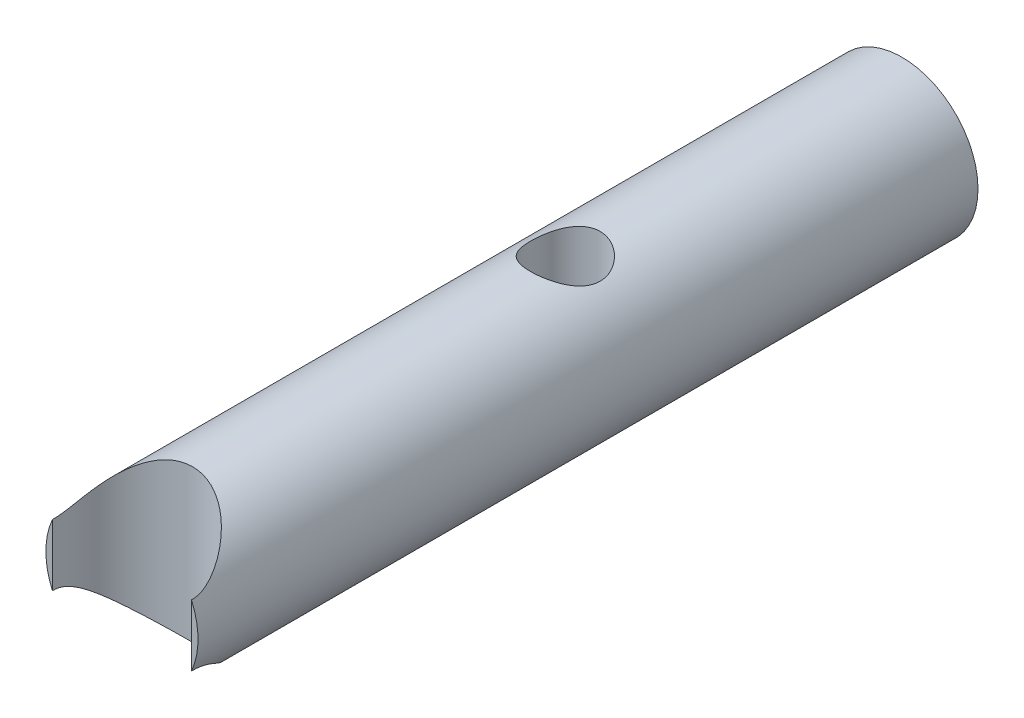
ISO-10303-21;
HEADER;
FILE_DESCRIPTION(('STEP AP214'),'2;1');
FILE_NAME('part.step','',(''),(''),'','','');
FILE_SCHEMA(('AUTOMOTIVE_DESIGN { 1 0 10303 214 1 1 1 1 }'));
ENDSEC;
DATA;
#1=APPLICATION_CONTEXT('core data for automotive mechanical design processes');
#2=APPLICATION_PROTOCOL_DEFINITION('international standard','automotive_design',2000,#1);
#3=PRODUCT_CONTEXT('',#1,'mechanical');
#4=PRODUCT('Part','Part','',(#3));
#5=PRODUCT_RELATED_PRODUCT_CATEGORY('part','',(#4));
#6=PRODUCT_DEFINITION_FORMATION('','',#4);
#7=PRODUCT_DEFINITION_CONTEXT('part definition',#1,'design');
#8=PRODUCT_DEFINITION('design','',#6,#7);
#9=PRODUCT_DEFINITION_SHAPE('','',#8);
#10=(LENGTH_UNIT() NAMED_UNIT(*) SI_UNIT(.MILLI.,.METRE.));
#11=(NAMED_UNIT(*) PLANE_ANGLE_UNIT() SI_UNIT($,.RADIAN.));
#12=(NAMED_UNIT(*) SI_UNIT($,.STERADIAN.) SOLID_ANGLE_UNIT());
#13=UNCERTAINTY_MEASURE_WITH_UNIT(LENGTH_MEASURE(1.E-05),#10,'distance_accuracy_value','');
#14=(GEOMETRIC_REPRESENTATION_CONTEXT(3) GLOBAL_UNCERTAINTY_ASSIGNED_CONTEXT((#13)) GLOBAL_UNIT_ASSIGNED_CONTEXT((#10,
#11,#12)) REPRESENTATION_CONTEXT('',''));
#15=CARTESIAN_POINT('',(0.,0.,0.));
#16=DIRECTION('',(0.,0.,1.));
#17=DIRECTION('',(1.,0.,0.));
#18=AXIS2_PLACEMENT_3D('',#15,#16,#17);
#19=CARTESIAN_POINT('',(0.,0.,28.04));
#20=DIRECTION('',(0.,0.,1.));
#21=DIRECTION('',(1.,0.,0.));
#22=AXIS2_PLACEMENT_3D('',#19,#20,#21);
#23=PLANE('',#22);
#24=DIRECTION('',(0.,1.,0.));
#25=VECTOR('',#24,1.);
#26=CARTESIAN_POINT('',(2.49967997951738,-2.735,28.04));
#27=LINE('',#26,#25);
#28=CARTESIAN_POINT('',(2.49967997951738,-1.10987611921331,28.04));
#29=VERTEX_POINT('',#28);
#30=CARTESIAN_POINT('',(2.49967997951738,1.10987611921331,28.04));
#31=VERTEX_POINT('',#30);
#32=EDGE_CURVE('E389',#29,#31,#27,.T.);
#33=ORIENTED_EDGE('',*,*,#32,.F.);
#34=CARTESIAN_POINT('',(0.,0.,28.04));
#35=DIRECTION('',(0.,0.,1.));
#36=DIRECTION('',(1.,0.,0.));
#37=AXIS2_PLACEMENT_3D('',#34,#35,#36);
#38=CIRCLE('',#37,2.735);
#39=EDGE_CURVE('E383',#29,#31,#38,.T.);
#40=ORIENTED_EDGE('',*,*,#39,.T.);
#41=EDGE_LOOP('',(#33,#40));
#42=FACE_BOUND('',#41,.T.);
#43=ADVANCED_FACE('F348',(#42),#23,.T.);
#44=CARTESIAN_POINT('',(0.,0.,28.04));
#45=DIRECTION('',(0.,0.,-1.));
#46=DIRECTION('',(-1.,0.,0.));
#47=AXIS2_PLACEMENT_3D('',#44,#45,#46);
#48=CYLINDRICAL_SURFACE('',#47,2.735);
#49=CARTESIAN_POINT('',(0.,-2.735,13.35));
#50=CARTESIAN_POINT('',(0.0663724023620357,-2.73499716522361,13.3499965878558));
#51=CARTESIAN_POINT('',(0.132843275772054,-2.73255715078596,13.3446825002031));
#52=CARTESIAN_POINT('',(0.263861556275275,-2.72303863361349,13.3236419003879));
#53=CARTESIAN_POINT('',(0.328404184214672,-2.71594946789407,13.3078914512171));
#54=CARTESIAN_POINT('',(0.453464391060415,-2.69788296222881,13.2666993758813));
#55=CARTESIAN_POINT('',(0.513995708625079,-2.68691980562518,13.2412930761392));
#56=CARTESIAN_POINT('',(0.629865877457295,-2.66214372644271,13.1816735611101));
#57=CARTESIAN_POINT('',(0.685205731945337,-2.64833135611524,13.1474620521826));
#58=CARTESIAN_POINT('',(0.792427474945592,-2.61830973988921,13.0691221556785));
#59=CARTESIAN_POINT('',(0.84397047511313,-2.60201224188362,13.0245641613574));
#60=CARTESIAN_POINT('',(0.93915409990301,-2.56919329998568,12.9277105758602));
#61=CARTESIAN_POINT('',(0.982789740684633,-2.55267172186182,12.8754101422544));
#62=CARTESIAN_POINT('',(1.06360908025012,-2.52011439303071,12.7606502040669));
#63=CARTESIAN_POINT('',(1.10022614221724,-2.50417203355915,12.6977622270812));
#64=CARTESIAN_POINT('',(1.16221291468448,-2.47601566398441,12.5658963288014));
#65=CARTESIAN_POINT('',(1.18758954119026,-2.46379936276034,12.4969221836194));
#66=CARTESIAN_POINT('',(1.22490745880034,-2.44545302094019,12.358726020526));
#67=CARTESIAN_POINT('',(1.23750543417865,-2.43902763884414,12.2897222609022));
#68=CARTESIAN_POINT('',(1.25094529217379,-2.4321645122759,12.1503048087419));
#69=CARTESIAN_POINT('',(1.25179574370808,-2.4317224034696,12.0798921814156));
#70=CARTESIAN_POINT('',(1.24220413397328,-2.43663118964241,11.9468792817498));
#71=CARTESIAN_POINT('',(1.23283602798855,-2.44143120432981,11.8841767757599));
#72=CARTESIAN_POINT('',(1.2049022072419,-2.45533633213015,11.761357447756));
#73=CARTESIAN_POINT('',(1.18633426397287,-2.46444248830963,11.7012412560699));
#74=CARTESIAN_POINT('',(1.14016129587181,-2.48614520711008,11.5836518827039));
#75=CARTESIAN_POINT('',(1.11235959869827,-2.49881672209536,11.5262703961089));
#76=CARTESIAN_POINT('',(1.04865127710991,-2.52621382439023,11.4167363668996));
#77=CARTESIAN_POINT('',(1.01274116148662,-2.54094029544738,11.3645860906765));
#78=CARTESIAN_POINT('',(0.929479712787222,-2.57263933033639,11.2613044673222));
#79=CARTESIAN_POINT('',(0.881328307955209,-2.58968649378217,11.210838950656));
#80=CARTESIAN_POINT('',(0.777116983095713,-2.62284256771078,11.1184501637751));
#81=CARTESIAN_POINT('',(0.721054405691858,-2.63895116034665,11.0765297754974));
#82=CARTESIAN_POINT('',(0.600235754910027,-2.66907069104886,11.0011607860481));
#83=CARTESIAN_POINT('',(0.535254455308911,-2.68299524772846,10.9680360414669));
#84=CARTESIAN_POINT('',(0.399841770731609,-2.70648478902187,10.9134310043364));
#85=CARTESIAN_POINT('',(0.329414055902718,-2.71605268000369,10.8919429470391));
#86=CARTESIAN_POINT('',(0.1906235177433,-2.72917351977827,10.8627371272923));
#87=CARTESIAN_POINT('',(0.122484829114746,-2.73311432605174,10.8541292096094));
#88=CARTESIAN_POINT('',(-0.0143738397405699,-2.73581719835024,10.8482094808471));
#89=CARTESIAN_POINT('',(-0.0830935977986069,-2.73458116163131,10.8508935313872));
#90=CARTESIAN_POINT('',(-0.214640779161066,-2.72731146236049,10.8668954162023));
#91=CARTESIAN_POINT('',(-0.277568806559,-2.72158105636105,10.8795413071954));
#92=CARTESIAN_POINT('',(-0.400314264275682,-2.70625226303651,10.9141182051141));
#93=CARTESIAN_POINT('',(-0.460131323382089,-2.69665341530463,10.9360503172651));
#94=CARTESIAN_POINT('',(-0.577067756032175,-2.67411203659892,10.9892580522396));
#95=CARTESIAN_POINT('',(-0.634046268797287,-2.66107518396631,11.0208019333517));
#96=CARTESIAN_POINT('',(-0.742105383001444,-2.63298815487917,11.0920453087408));
#97=CARTESIAN_POINT('',(-0.793183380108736,-2.61793709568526,11.131748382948));
#98=CARTESIAN_POINT('',(-0.892559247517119,-2.58582979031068,11.2220930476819));
#99=CARTESIAN_POINT('',(-0.940255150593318,-2.56871168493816,11.2733763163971));
#100=CARTESIAN_POINT('',(-1.02658207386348,-2.53544851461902,11.3833961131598));
#101=CARTESIAN_POINT('',(-1.06520926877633,-2.51930386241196,11.4421357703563));
#102=CARTESIAN_POINT('',(-1.13326671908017,-2.48944894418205,11.5676091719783));
#103=CARTESIAN_POINT('',(-1.16240482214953,-2.47582077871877,11.6345224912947));
#104=CARTESIAN_POINT('',(-1.20871129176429,-2.45355122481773,11.773133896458));
#105=CARTESIAN_POINT('',(-1.22589223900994,-2.44490459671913,11.8448268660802));
#106=CARTESIAN_POINT('',(-1.24643587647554,-2.43449032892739,11.9841808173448));
#107=CARTESIAN_POINT('',(-1.25088072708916,-2.43218469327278,12.0516420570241));
#108=CARTESIAN_POINT('',(-1.24883066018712,-2.43323851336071,12.1863445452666));
#109=CARTESIAN_POINT('',(-1.24233846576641,-2.43659655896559,12.2535858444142));
#110=CARTESIAN_POINT('',(-1.21956205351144,-2.44806799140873,12.3812304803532));
#111=CARTESIAN_POINT('',(-1.20396488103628,-2.45584679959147,12.4417897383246));
#112=CARTESIAN_POINT('',(-1.16417245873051,-2.47495694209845,12.5594128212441));
#113=CARTESIAN_POINT('',(-1.13997468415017,-2.48628931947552,12.6164756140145));
#114=CARTESIAN_POINT('',(-1.08186347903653,-2.5121443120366,12.7295835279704));
#115=CARTESIAN_POINT('',(-1.04741793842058,-2.52682715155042,12.785317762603));
#116=CARTESIAN_POINT('',(-0.970456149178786,-2.55737231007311,12.8905494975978));
#117=CARTESIAN_POINT('',(-0.92793629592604,-2.57323515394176,12.9400441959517));
#118=CARTESIAN_POINT('',(-0.8312839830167,-2.60615328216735,13.0362388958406));
#119=CARTESIAN_POINT('',(-0.776433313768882,-2.62317932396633,13.0822309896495));
#120=CARTESIAN_POINT('',(-0.659217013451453,-2.65505978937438,13.1644512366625));
#121=CARTESIAN_POINT('',(-0.596847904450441,-2.66991320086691,13.2006748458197));
#122=CARTESIAN_POINT('',(-0.466673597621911,-2.69570161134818,13.261828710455));
#123=CARTESIAN_POINT('',(-0.398916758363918,-2.70666750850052,13.2868484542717));
#124=CARTESIAN_POINT('',(-0.259627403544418,-2.7235460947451,13.3248562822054));
#125=CARTESIAN_POINT('',(-0.188106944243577,-2.72947398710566,13.3378805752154));
#126=CARTESIAN_POINT('',(-0.0967321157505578,-2.73335792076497,13.3464030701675));
#127=CARTESIAN_POINT('',(-0.0774179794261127,-2.73397254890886,13.3477505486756));
#128=CARTESIAN_POINT('',(-0.0387386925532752,-2.73479400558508,13.3495495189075));
#129=CARTESIAN_POINT('',(-0.0193735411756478,-2.73500082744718,13.350000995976));
#130=CARTESIAN_POINT('',(0.,-2.735,13.35));
#131=B_SPLINE_CURVE_WITH_KNOTS('',3,(#49,#50,#51,#52,#53,#54,#55,#56,#57,#58,#59,#60,#61,#62,
#63,#64,#65,#66,#67,#68,#69,#70,#71,#72,#73,#74,#75,#76,#77,#78,#79,#80,#81,#82,#83,#84,#85,#86,
#87,#88,#89,#90,#91,#92,#93,#94,#95,#96,#97,#98,#99,#100,#101,#102,#103,#104,#105,#106,#107,
#108,#109,#110,#111,#112,#113,#114,#115,#116,#117,#118,#119,#120,#121,#122,#123,#124,#125,#126,
#127,#128,#129,#130),.UNSPECIFIED.,.T.,.F.,(4,2,2,2,2,2,2,2,2,2,2,2,2,2,2,2,2,2,2,2,2,2,2,2,2,2,
2,2,2,2,2,2,2,2,2,2,2,2,2,2,4),(0.,0.199037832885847,0.398533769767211,0.597306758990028,
0.79604125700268,1.00531223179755,1.21471465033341,1.43708025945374,1.65930886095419,
1.86942947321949,2.07939681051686,2.26925045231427,2.45915010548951,2.65338594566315,
2.84770557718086,3.06216563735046,3.27669790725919,3.49828369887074,3.7197214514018,
3.92500604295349,4.13021540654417,4.32265816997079,4.51512384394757,4.71354839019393,
4.91206018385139,5.12738683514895,5.34280415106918,5.56433561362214,5.78563363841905,
5.98747377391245,6.18926366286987,6.37749887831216,6.56578939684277,6.76639997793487,
6.96710032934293,7.18679672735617,7.40659514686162,7.62460521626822,7.84195503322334,
7.90005153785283,7.9581489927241),.UNSPECIFIED.);
#132=CARTESIAN_POINT('',(0.,-2.735,13.35));
#133=VERTEX_POINT('',#132);
#134=EDGE_CURVE('E11',#133,#133,#131,.T.);
#135=ORIENTED_EDGE('',*,*,#134,.T.);
#136=EDGE_LOOP('',(#135));
#137=FACE_BOUND('',#136,.T.);
#138=CARTESIAN_POINT('',(0.,2.735,13.35));
#139=CARTESIAN_POINT('',(-0.0663724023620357,2.73499716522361,13.3499965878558));
#140=CARTESIAN_POINT('',(-0.132843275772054,2.73255715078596,13.3446825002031));
#141=CARTESIAN_POINT('',(-0.263861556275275,2.72303863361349,13.3236419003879));
#142=CARTESIAN_POINT('',(-0.328404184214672,2.71594946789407,13.3078914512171));
#143=CARTESIAN_POINT('',(-0.453464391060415,2.69788296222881,13.2666993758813));
#144=CARTESIAN_POINT('',(-0.513995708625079,2.68691980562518,13.2412930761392));
#145=CARTESIAN_POINT('',(-0.629865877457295,2.66214372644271,13.1816735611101));
#146=CARTESIAN_POINT('',(-0.685205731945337,2.64833135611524,13.1474620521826));
#147=CARTESIAN_POINT('',(-0.792427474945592,2.61830973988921,13.0691221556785));
#148=CARTESIAN_POINT('',(-0.84397047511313,2.60201224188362,13.0245641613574));
#149=CARTESIAN_POINT('',(-0.93915409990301,2.56919329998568,12.9277105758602));
#150=CARTESIAN_POINT('',(-0.982789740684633,2.55267172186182,12.8754101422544));
#151=CARTESIAN_POINT('',(-1.06360908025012,2.52011439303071,12.7606502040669));
#152=CARTESIAN_POINT('',(-1.10022614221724,2.50417203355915,12.6977622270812));
#153=CARTESIAN_POINT('',(-1.16221291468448,2.47601566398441,12.5658963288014));
#154=CARTESIAN_POINT('',(-1.18758954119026,2.46379936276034,12.4969221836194));
#155=CARTESIAN_POINT('',(-1.22490745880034,2.44545302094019,12.358726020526));
#156=CARTESIAN_POINT('',(-1.23750543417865,2.43902763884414,12.2897222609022));
#157=CARTESIAN_POINT('',(-1.25094529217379,2.4321645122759,12.1503048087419));
#158=CARTESIAN_POINT('',(-1.25179574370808,2.4317224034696,12.0798921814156));
#159=CARTESIAN_POINT('',(-1.24220413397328,2.43663118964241,11.9468792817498));
#160=CARTESIAN_POINT('',(-1.23283602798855,2.44143120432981,11.8841767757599));
#161=CARTESIAN_POINT('',(-1.2049022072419,2.45533633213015,11.761357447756));
#162=CARTESIAN_POINT('',(-1.18633426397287,2.46444248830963,11.7012412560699));
#163=CARTESIAN_POINT('',(-1.14016129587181,2.48614520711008,11.5836518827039));
#164=CARTESIAN_POINT('',(-1.11235959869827,2.49881672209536,11.5262703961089));
#165=CARTESIAN_POINT('',(-1.04865127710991,2.52621382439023,11.4167363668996));
#166=CARTESIAN_POINT('',(-1.01274116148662,2.54094029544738,11.3645860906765));
#167=CARTESIAN_POINT('',(-0.929479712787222,2.57263933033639,11.2613044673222));
#168=CARTESIAN_POINT('',(-0.881328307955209,2.58968649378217,11.210838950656));
#169=CARTESIAN_POINT('',(-0.777116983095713,2.62284256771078,11.1184501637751));
#170=CARTESIAN_POINT('',(-0.721054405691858,2.63895116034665,11.0765297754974));
#171=CARTESIAN_POINT('',(-0.600235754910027,2.66907069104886,11.0011607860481));
#172=CARTESIAN_POINT('',(-0.535254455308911,2.68299524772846,10.9680360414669));
#173=CARTESIAN_POINT('',(-0.399841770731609,2.70648478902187,10.9134310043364));
#174=CARTESIAN_POINT('',(-0.329414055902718,2.71605268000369,10.8919429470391));
#175=CARTESIAN_POINT('',(-0.1906235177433,2.72917351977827,10.8627371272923));
#176=CARTESIAN_POINT('',(-0.122484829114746,2.73311432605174,10.8541292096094));
#177=CARTESIAN_POINT('',(0.0143738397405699,2.73581719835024,10.8482094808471));
#178=CARTESIAN_POINT('',(0.0830935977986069,2.73458116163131,10.8508935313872));
#179=CARTESIAN_POINT('',(0.214640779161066,2.72731146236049,10.8668954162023));
#180=CARTESIAN_POINT('',(0.277568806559,2.72158105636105,10.8795413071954));
#181=CARTESIAN_POINT('',(0.400314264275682,2.70625226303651,10.9141182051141));
#182=CARTESIAN_POINT('',(0.460131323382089,2.69665341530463,10.9360503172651));
#183=CARTESIAN_POINT('',(0.577067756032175,2.67411203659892,10.9892580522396));
#184=CARTESIAN_POINT('',(0.634046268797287,2.66107518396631,11.0208019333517));
#185=CARTESIAN_POINT('',(0.742105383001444,2.63298815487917,11.0920453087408));
#186=CARTESIAN_POINT('',(0.793183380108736,2.61793709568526,11.131748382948));
#187=CARTESIAN_POINT('',(0.892559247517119,2.58582979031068,11.2220930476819));
#188=CARTESIAN_POINT('',(0.940255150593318,2.56871168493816,11.2733763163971));
#189=CARTESIAN_POINT('',(1.02658207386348,2.53544851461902,11.3833961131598));
#190=CARTESIAN_POINT('',(1.06520926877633,2.51930386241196,11.4421357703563));
#191=CARTESIAN_POINT('',(1.13326671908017,2.48944894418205,11.5676091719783));
#192=CARTESIAN_POINT('',(1.16240482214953,2.47582077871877,11.6345224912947));
#193=CARTESIAN_POINT('',(1.20871129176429,2.45355122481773,11.773133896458));
#194=CARTESIAN_POINT('',(1.22589223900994,2.44490459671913,11.8448268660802));
#195=CARTESIAN_POINT('',(1.24643587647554,2.43449032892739,11.9841808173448));
#196=CARTESIAN_POINT('',(1.25088072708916,2.43218469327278,12.0516420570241));
#197=CARTESIAN_POINT('',(1.24883066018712,2.43323851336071,12.1863445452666));
#198=CARTESIAN_POINT('',(1.24233846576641,2.43659655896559,12.2535858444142));
#199=CARTESIAN_POINT('',(1.21956205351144,2.44806799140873,12.3812304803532));
#200=CARTESIAN_POINT('',(1.20396488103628,2.45584679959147,12.4417897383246));
#201=CARTESIAN_POINT('',(1.16417245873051,2.47495694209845,12.5594128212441));
#202=CARTESIAN_POINT('',(1.13997468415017,2.48628931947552,12.6164756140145));
#203=CARTESIAN_POINT('',(1.08186347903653,2.5121443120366,12.7295835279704));
#204=CARTESIAN_POINT('',(1.04741793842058,2.52682715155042,12.785317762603));
#205=CARTESIAN_POINT('',(0.970456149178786,2.55737231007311,12.8905494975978));
#206=CARTESIAN_POINT('',(0.92793629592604,2.57323515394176,12.9400441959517));
#207=CARTESIAN_POINT('',(0.8312839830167,2.60615328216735,13.0362388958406));
#208=CARTESIAN_POINT('',(0.776433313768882,2.62317932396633,13.0822309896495));
#209=CARTESIAN_POINT('',(0.659217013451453,2.65505978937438,13.1644512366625));
#210=CARTESIAN_POINT('',(0.596847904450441,2.66991320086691,13.2006748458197));
#211=CARTESIAN_POINT('',(0.466673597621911,2.69570161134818,13.261828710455));
#212=CARTESIAN_POINT('',(0.398916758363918,2.70666750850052,13.2868484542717));
#213=CARTESIAN_POINT('',(0.259627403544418,2.7235460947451,13.3248562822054));
#214=CARTESIAN_POINT('',(0.188106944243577,2.72947398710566,13.3378805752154));
#215=CARTESIAN_POINT('',(0.0967321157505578,2.73335792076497,13.3464030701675));
#216=CARTESIAN_POINT('',(0.0774179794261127,2.73397254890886,13.3477505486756));
#217=CARTESIAN_POINT('',(0.0387386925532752,2.73479400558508,13.3495495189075));
#218=CARTESIAN_POINT('',(0.0193735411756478,2.73500082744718,13.350000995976));
#219=CARTESIAN_POINT('',(0.,2.735,13.35));
#220=B_SPLINE_CURVE_WITH_KNOTS('',3,(#138,#139,#140,#141,#142,#143,#144,#145,#146,#147,#148,
#149,#150,#151,#152,#153,#154,#155,#156,#157,#158,#159,#160,#161,#162,#163,#164,#165,#166,#167,
#168,#169,#170,#171,#172,#173,#174,#175,#176,#177,#178,#179,#180,#181,#182,#183,#184,#185,#186,
#187,#188,#189,#190,#191,#192,#193,#194,#195,#196,#197,#198,#199,#200,#201,#202,#203,#204,#205,
#206,#207,#208,#209,#210,#211,#212,#213,#214,#215,#216,#217,#218,#219),.UNSPECIFIED.,.T.,.F.,(4,
2,2,2,2,2,2,2,2,2,2,2,2,2,2,2,2,2,2,2,2,2,2,2,2,2,2,2,2,2,2,2,2,2,2,2,2,2,2,2,4),(0.,
0.199037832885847,0.398533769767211,0.597306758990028,0.79604125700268,1.00531223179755,
1.21471465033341,1.43708025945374,1.65930886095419,1.86942947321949,2.07939681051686,
2.26925045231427,2.45915010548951,2.65338594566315,2.84770557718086,3.06216563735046,
3.27669790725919,3.49828369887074,3.7197214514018,3.92500604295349,4.13021540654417,
4.32265816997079,4.51512384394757,4.71354839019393,4.91206018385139,5.12738683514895,
5.34280415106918,5.56433561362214,5.78563363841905,5.98747377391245,6.18926366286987,
6.37749887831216,6.56578939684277,6.76639997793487,6.96710032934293,7.18679672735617,
7.40659514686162,7.62460521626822,7.84195503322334,7.90005153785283,7.9581489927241),.UNSPECIFIED.);
#221=CARTESIAN_POINT('',(0.,2.735,13.35));
#222=VERTEX_POINT('',#221);
#223=EDGE_CURVE('E360',#222,#222,#220,.T.);
#224=ORIENTED_EDGE('',*,*,#223,.T.);
#225=EDGE_LOOP('',(#224));
#226=FACE_BOUND('',#225,.T.);
#227=CARTESIAN_POINT('',(-2.49967997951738,1.10987611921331,28.04));
#228=VERTEX_POINT('',#227);
#229=CARTESIAN_POINT('',(-2.49967997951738,-1.10987611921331,28.04));
#230=VERTEX_POINT('',#229);
#231=EDGE_CURVE('E381',#228,#230,#38,.T.);
#232=ORIENTED_EDGE('',*,*,#231,.F.);
#233=CARTESIAN_POINT('',(-2.49967997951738,1.10987611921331,28.04));
#234=CARTESIAN_POINT('',(-2.5002399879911,1.10859991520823,28.0054156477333));
#235=CARTESIAN_POINT('',(-2.50006924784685,1.10899771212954,27.970783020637));
#236=CARTESIAN_POINT('',(-2.49830747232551,1.11296766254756,27.9018191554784));
#237=CARTESIAN_POINT('',(-2.49671991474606,1.1165320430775,27.8674873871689));
#238=CARTESIAN_POINT('',(-2.48998311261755,1.13151700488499,27.7666444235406));
#239=CARTESIAN_POINT('',(-2.48287772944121,1.14719462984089,27.7008819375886));
#240=CARTESIAN_POINT('',(-2.45984026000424,1.19598962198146,27.5438515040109));
#241=CARTESIAN_POINT('',(-2.4413692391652,1.23378800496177,27.4545036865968));
#242=CARTESIAN_POINT('',(-2.39632504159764,1.31917392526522,27.2818842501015));
#243=CARTESIAN_POINT('',(-2.36966239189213,1.36686757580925,27.1986929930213));
#244=CARTESIAN_POINT('',(-2.31068296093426,1.46425854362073,27.0422192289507));
#245=CARTESIAN_POINT('',(-2.27873600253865,1.5137196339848,26.9686458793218));
#246=CARTESIAN_POINT('',(-2.20852848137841,1.61443596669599,26.8258026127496));
#247=CARTESIAN_POINT('',(-2.17026300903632,1.66569257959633,26.7565361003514));
#248=CARTESIAN_POINT('',(-2.08754420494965,1.76825234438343,26.622189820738));
#249=CARTESIAN_POINT('',(-2.04310741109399,1.81955501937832,26.5570995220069));
#250=CARTESIAN_POINT('',(-1.94787351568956,1.9211629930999,26.4309125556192));
#251=CARTESIAN_POINT('',(-1.89707545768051,1.97146814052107,26.3698164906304));
#252=CARTESIAN_POINT('',(-1.75440359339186,2.10158759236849,26.2141439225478));
#253=CARTESIAN_POINT('',(-1.65701454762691,2.17973182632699,26.1231019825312));
#254=CARTESIAN_POINT('',(-1.44438253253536,2.3260684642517,25.954993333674));
#255=CARTESIAN_POINT('',(-1.32916921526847,2.39427703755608,25.87790386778));
#256=CARTESIAN_POINT('',(-1.10936322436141,2.50219328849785,25.7569417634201));
#257=CARTESIAN_POINT('',(-1.00820689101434,2.54486096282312,25.7094977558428));
#258=CARTESIAN_POINT('',(-0.796771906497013,2.61875710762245,25.6276649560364));
#259=CARTESIAN_POINT('',(-0.686498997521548,2.64999271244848,25.5932680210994));
#260=CARTESIAN_POINT('',(-0.45843131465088,2.69884221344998,25.5395834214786));
#261=CARTESIAN_POINT('',(-0.340586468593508,2.71635252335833,25.5204106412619));
#262=CARTESIAN_POINT('',(-0.1021033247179,2.73570449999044,25.4992253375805));
#263=CARTESIAN_POINT('',(0.0185332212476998,2.7375557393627,25.4972023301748));
#264=CARTESIAN_POINT('',(0.243721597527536,2.72617161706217,25.5096606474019));
#265=CARTESIAN_POINT('',(0.348481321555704,2.71470285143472,25.522209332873));
#266=CARTESIAN_POINT('',(0.553758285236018,2.68037487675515,25.5598679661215));
#267=CARTESIAN_POINT('',(0.654274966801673,2.65751417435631,25.5849795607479));
#268=CARTESIAN_POINT('',(0.851313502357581,2.60120336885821,25.6470847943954));
#269=CARTESIAN_POINT('',(0.947674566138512,2.56750481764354,25.6843575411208));
#270=CARTESIAN_POINT('',(1.13231000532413,2.4916022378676,25.768812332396));
#271=CARTESIAN_POINT('',(1.22058049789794,2.44939415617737,25.8159990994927));
#272=CARTESIAN_POINT('',(1.43081796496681,2.33530084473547,25.9445956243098));
#273=CARTESIAN_POINT('',(1.54728942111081,2.2591930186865,26.0312539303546));
#274=CARTESIAN_POINT('',(1.76038769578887,2.09743093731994,26.2191764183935));
#275=CARTESIAN_POINT('',(1.85695993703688,2.01175139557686,26.3204795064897));
#276=CARTESIAN_POINT('',(1.98823287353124,1.87913640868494,26.4827943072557));
#277=CARTESIAN_POINT('',(2.03013743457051,1.83368592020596,26.5393591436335));
#278=CARTESIAN_POINT('',(2.10893822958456,1.74247859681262,26.6556359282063));
#279=CARTESIAN_POINT('',(2.14583574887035,1.69672184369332,26.7153470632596));
#280=CARTESIAN_POINT('',(2.21462414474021,1.6058967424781,26.8379429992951));
#281=CARTESIAN_POINT('',(2.24652128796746,1.56082759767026,26.9008236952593));
#282=CARTESIAN_POINT('',(2.30530126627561,1.47262117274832,27.03013995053));
#283=CARTESIAN_POINT('',(2.33218754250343,1.42948258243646,27.0965730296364));
#284=CARTESIAN_POINT('',(2.38043498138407,1.34758232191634,27.2327415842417));
#285=CARTESIAN_POINT('',(2.40186411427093,1.30877057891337,27.3024221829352));
#286=CARTESIAN_POINT('',(2.43911873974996,1.23794986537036,27.4466241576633));
#287=CARTESIAN_POINT('',(2.45495302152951,1.20593025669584,27.5211377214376));
#288=CARTESIAN_POINT('',(2.4771746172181,1.15945707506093,27.6576193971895));
#289=CARTESIAN_POINT('',(2.48489592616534,1.14265869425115,27.7185429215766));
#290=CARTESIAN_POINT('',(2.49580482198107,1.11865063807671,27.8425717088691));
#291=CARTESIAN_POINT('',(2.49900852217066,1.1114068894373,27.9056683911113));
#292=CARTESIAN_POINT('',(2.50010554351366,1.10891065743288,27.9925902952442));
#293=CARTESIAN_POINT('',(2.5000663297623,1.10899339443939,28.0163153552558));
#294=CARTESIAN_POINT('',(2.49967997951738,1.10987611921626,28.0400000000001));
#295=B_SPLINE_CURVE_WITH_KNOTS('',3,(#233,#234,#235,#236,#237,#238,#239,#240,#241,#242,#243,
#244,#245,#246,#247,#248,#249,#250,#251,#252,#253,#254,#255,#256,#257,#258,#259,#260,#261,#262,
#263,#264,#265,#266,#267,#268,#269,#270,#271,#272,#273,#274,#275,#276,#277,#278,#279,#280,#281,
#282,#283,#284,#285,#286,#287,#288,#289,#290,#291,#292,#293,#294),.UNSPECIFIED.,.F.,.F.,(4,2,2,
2,2,2,2,2,2,2,2,2,2,2,2,2,2,2,2,2,2,2,2,2,2,2,2,2,2,2,4),(0.,0.103748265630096,
0.207242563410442,0.410093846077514,0.704711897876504,1.00266976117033,1.28500274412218,
1.56755614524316,1.84936646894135,2.1312192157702,2.59306051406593,3.05414160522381,
3.41155429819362,3.76874356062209,4.12860328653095,4.48824300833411,4.80514684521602,
5.12209223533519,5.44689422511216,5.77185128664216,6.26091787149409,6.75130846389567,
7.00251956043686,7.25366604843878,7.50449523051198,7.75515151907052,8.00251353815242,
8.24948521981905,8.43978692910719,8.62940814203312,8.70052719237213),.UNSPECIFIED.);
#296=EDGE_CURVE('E367',#228,#31,#295,.T.);
#297=ORIENTED_EDGE('',*,*,#296,.T.);
#298=ORIENTED_EDGE('',*,*,#39,.F.);
#299=CARTESIAN_POINT('',(2.49967997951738,-1.10987611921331,28.04));
#300=CARTESIAN_POINT('',(2.5002399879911,-1.10859991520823,28.0054156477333));
#301=CARTESIAN_POINT('',(2.50006924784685,-1.10899771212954,27.970783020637));
#302=CARTESIAN_POINT('',(2.49830747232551,-1.11296766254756,27.9018191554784));
#303=CARTESIAN_POINT('',(2.49671991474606,-1.1165320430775,27.8674873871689));
#304=CARTESIAN_POINT('',(2.48998311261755,-1.13151700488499,27.7666444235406));
#305=CARTESIAN_POINT('',(2.48287772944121,-1.14719462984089,27.7008819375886));
#306=CARTESIAN_POINT('',(2.45984026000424,-1.19598962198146,27.5438515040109));
#307=CARTESIAN_POINT('',(2.4413692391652,-1.23378800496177,27.4545036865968));
#308=CARTESIAN_POINT('',(2.39632504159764,-1.31917392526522,27.2818842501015));
#309=CARTESIAN_POINT('',(2.36966239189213,-1.36686757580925,27.1986929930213));
#310=CARTESIAN_POINT('',(2.31068296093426,-1.46425854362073,27.0422192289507));
#311=CARTESIAN_POINT('',(2.27873600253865,-1.5137196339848,26.9686458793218));
#312=CARTESIAN_POINT('',(2.20852848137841,-1.61443596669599,26.8258026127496));
#313=CARTESIAN_POINT('',(2.17026300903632,-1.66569257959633,26.7565361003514));
#314=CARTESIAN_POINT('',(2.08754420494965,-1.76825234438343,26.622189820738));
#315=CARTESIAN_POINT('',(2.04310741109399,-1.81955501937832,26.5570995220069));
#316=CARTESIAN_POINT('',(1.94787351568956,-1.9211629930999,26.4309125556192));
#317=CARTESIAN_POINT('',(1.89707545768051,-1.97146814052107,26.3698164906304));
#318=CARTESIAN_POINT('',(1.75440359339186,-2.10158759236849,26.2141439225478));
#319=CARTESIAN_POINT('',(1.65701454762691,-2.17973182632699,26.1231019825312));
#320=CARTESIAN_POINT('',(1.44438253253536,-2.3260684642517,25.954993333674));
#321=CARTESIAN_POINT('',(1.32916921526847,-2.39427703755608,25.87790386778));
#322=CARTESIAN_POINT('',(1.10936322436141,-2.50219328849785,25.7569417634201));
#323=CARTESIAN_POINT('',(1.00820689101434,-2.54486096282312,25.7094977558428));
#324=CARTESIAN_POINT('',(0.796771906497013,-2.61875710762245,25.6276649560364));
#325=CARTESIAN_POINT('',(0.686498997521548,-2.64999271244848,25.5932680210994));
#326=CARTESIAN_POINT('',(0.45843131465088,-2.69884221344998,25.5395834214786));
#327=CARTESIAN_POINT('',(0.340586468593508,-2.71635252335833,25.5204106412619));
#328=CARTESIAN_POINT('',(0.1021033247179,-2.73570449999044,25.4992253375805));
#329=CARTESIAN_POINT('',(-0.0185332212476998,-2.7375557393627,25.4972023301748));
#330=CARTESIAN_POINT('',(-0.243721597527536,-2.72617161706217,25.5096606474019));
#331=CARTESIAN_POINT('',(-0.348481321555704,-2.71470285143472,25.522209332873));
#332=CARTESIAN_POINT('',(-0.553758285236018,-2.68037487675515,25.5598679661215));
#333=CARTESIAN_POINT('',(-0.654274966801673,-2.65751417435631,25.5849795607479));
#334=CARTESIAN_POINT('',(-0.851313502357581,-2.60120336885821,25.6470847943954));
#335=CARTESIAN_POINT('',(-0.947674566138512,-2.56750481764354,25.6843575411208));
#336=CARTESIAN_POINT('',(-1.13231000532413,-2.4916022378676,25.768812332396));
#337=CARTESIAN_POINT('',(-1.22058049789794,-2.44939415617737,25.8159990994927));
#338=CARTESIAN_POINT('',(-1.43081796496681,-2.33530084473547,25.9445956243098));
#339=CARTESIAN_POINT('',(-1.54728942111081,-2.2591930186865,26.0312539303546));
#340=CARTESIAN_POINT('',(-1.76038769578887,-2.09743093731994,26.2191764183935));
#341=CARTESIAN_POINT('',(-1.85695993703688,-2.01175139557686,26.3204795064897));
#342=CARTESIAN_POINT('',(-1.98823287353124,-1.87913640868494,26.4827943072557));
#343=CARTESIAN_POINT('',(-2.03013743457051,-1.83368592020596,26.5393591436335));
#344=CARTESIAN_POINT('',(-2.10893822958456,-1.74247859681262,26.6556359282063));
#345=CARTESIAN_POINT('',(-2.14583574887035,-1.69672184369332,26.7153470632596));
#346=CARTESIAN_POINT('',(-2.21462414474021,-1.6058967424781,26.8379429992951));
#347=CARTESIAN_POINT('',(-2.24652128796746,-1.56082759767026,26.9008236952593));
#348=CARTESIAN_POINT('',(-2.30530126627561,-1.47262117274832,27.03013995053));
#349=CARTESIAN_POINT('',(-2.33218754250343,-1.42948258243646,27.0965730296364));
#350=CARTESIAN_POINT('',(-2.38043498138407,-1.34758232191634,27.2327415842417));
#351=CARTESIAN_POINT('',(-2.40186411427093,-1.30877057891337,27.3024221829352));
#352=CARTESIAN_POINT('',(-2.43911873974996,-1.23794986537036,27.4466241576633));
#353=CARTESIAN_POINT('',(-2.45495302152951,-1.20593025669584,27.5211377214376));
#354=CARTESIAN_POINT('',(-2.4771746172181,-1.15945707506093,27.6576193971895));
#355=CARTESIAN_POINT('',(-2.48489592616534,-1.14265869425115,27.7185429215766));
#356=CARTESIAN_POINT('',(-2.49580482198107,-1.11865063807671,27.8425717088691));
#357=CARTESIAN_POINT('',(-2.49900852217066,-1.1114068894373,27.9056683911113));
#358=CARTESIAN_POINT('',(-2.50010554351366,-1.10891065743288,27.9925902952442));
#359=CARTESIAN_POINT('',(-2.5000663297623,-1.10899339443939,28.0163153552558));
#360=CARTESIAN_POINT('',(-2.49967997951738,-1.10987611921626,28.0400000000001));
#361=B_SPLINE_CURVE_WITH_KNOTS('',3,(#299,#300,#301,#302,#303,#304,#305,#306,#307,#308,#309,
#310,#311,#312,#313,#314,#315,#316,#317,#318,#319,#320,#321,#322,#323,#324,#325,#326,#327,#328,
#329,#330,#331,#332,#333,#334,#335,#336,#337,#338,#339,#340,#341,#342,#343,#344,#345,#346,#347,
#348,#349,#350,#351,#352,#353,#354,#355,#356,#357,#358,#359,#360),.UNSPECIFIED.,.F.,.F.,(4,2,2,
2,2,2,2,2,2,2,2,2,2,2,2,2,2,2,2,2,2,2,2,2,2,2,2,2,2,2,4),(0.,0.103748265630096,
0.207242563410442,0.410093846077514,0.704711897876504,1.00266976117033,1.28500274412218,
1.56755614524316,1.84936646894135,2.1312192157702,2.59306051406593,3.05414160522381,
3.41155429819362,3.76874356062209,4.12860328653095,4.48824300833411,4.80514684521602,
5.12209223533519,5.44689422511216,5.77185128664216,6.26091787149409,6.75130846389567,
7.00251956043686,7.25366604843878,7.50449523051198,7.75515151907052,8.00251353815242,
8.24948521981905,8.43978692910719,8.62940814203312,8.70052719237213),.UNSPECIFIED.);
#362=EDGE_CURVE('E378',#29,#230,#361,.T.);
#363=ORIENTED_EDGE('',*,*,#362,.T.);
#364=EDGE_LOOP('',(#232,#297,#298,#363));
#365=FACE_BOUND('',#364,.T.);
#366=CARTESIAN_POINT('',(0.,0.,0.));
#367=DIRECTION('',(0.,0.,1.));
#368=DIRECTION('',(1.,0.,0.));
#369=AXIS2_PLACEMENT_3D('',#366,#367,#368);
#370=CIRCLE('',#369,2.735);
#371=CARTESIAN_POINT('',(2.735,0.,0.));
#372=VERTEX_POINT('',#371);
#373=EDGE_CURVE('E393',#372,#372,#370,.T.);
#374=ORIENTED_EDGE('',*,*,#373,.T.);
#375=EDGE_LOOP('',(#374));
#376=FACE_BOUND('',#375,.T.);
#377=ADVANCED_FACE('F350',(#137,#226,#365,#376),#48,.T.);
#378=DIRECTION('',(0.,1.,0.));
#379=VECTOR('',#378,1.);
#380=CARTESIAN_POINT('',(-2.49967997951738,-2.735,28.04));
#381=LINE('',#380,#379);
#382=EDGE_CURVE('E386',#228,#230,#381,.F.);
#383=ORIENTED_EDGE('',*,*,#382,.F.);
#384=ORIENTED_EDGE('',*,*,#231,.T.);
#385=EDGE_LOOP('',(#383,#384));
#386=FACE_BOUND('',#385,.T.);
#387=ADVANCED_FACE('F391',(#386),#23,.T.);
#388=CARTESIAN_POINT('',(0.,0.,0.));
#389=DIRECTION('',(0.,0.,1.));
#390=DIRECTION('',(1.,0.,0.));
#391=AXIS2_PLACEMENT_3D('',#388,#389,#390);
#392=PLANE('',#391);
#393=ORIENTED_EDGE('',*,*,#373,.F.);
#394=EDGE_LOOP('',(#393));
#395=FACE_BOUND('',#394,.T.);
#396=ADVANCED_FACE('F409',(#395),#392,.F.);
#397=CARTESIAN_POINT('',(0.,-2.735,28.));
#398=DIRECTION('',(0.,1.,0.));
#399=DIRECTION('',(0.,0.,1.));
#400=AXIS2_PLACEMENT_3D('',#397,#398,#399);
#401=CYLINDRICAL_SURFACE('',#400,2.5);
#402=ORIENTED_EDGE('',*,*,#296,.F.);
#403=ORIENTED_EDGE('',*,*,#382,.T.);
#404=ORIENTED_EDGE('',*,*,#362,.F.);
#405=ORIENTED_EDGE('',*,*,#32,.T.);
#406=EDGE_LOOP('',(#402,#403,#404,#405));
#407=FACE_BOUND('',#406,.T.);
#408=ADVANCED_FACE('F387',(#407),#401,.F.);
#409=CARTESIAN_POINT('',(0.,-2.735,12.1));
#410=DIRECTION('',(0.,1.,0.));
#411=DIRECTION('',(0.,0.,1.));
#412=AXIS2_PLACEMENT_3D('',#409,#410,#411);
#413=CYLINDRICAL_SURFACE('',#412,1.25);
#414=ORIENTED_EDGE('',*,*,#223,.F.);
#415=EDGE_LOOP('',(#414));
#416=FACE_BOUND('',#415,.T.);
#417=ORIENTED_EDGE('',*,*,#134,.F.);
#418=EDGE_LOOP('',(#417));
#419=FACE_BOUND('',#418,.T.);
#420=ADVANCED_FACE('F400',(#416,#419),#413,.F.);
#421=CLOSED_SHELL('',(#43,#377,#387,#396,#408,#420));
#422=MANIFOLD_SOLID_BREP('B2',#421);
#423=ADVANCED_BREP_SHAPE_REPRESENTATION('',(#18,#422),#14);
#424=SHAPE_DEFINITION_REPRESENTATION(#9,#423);
ENDSEC;
END-ISO-10303-21;
